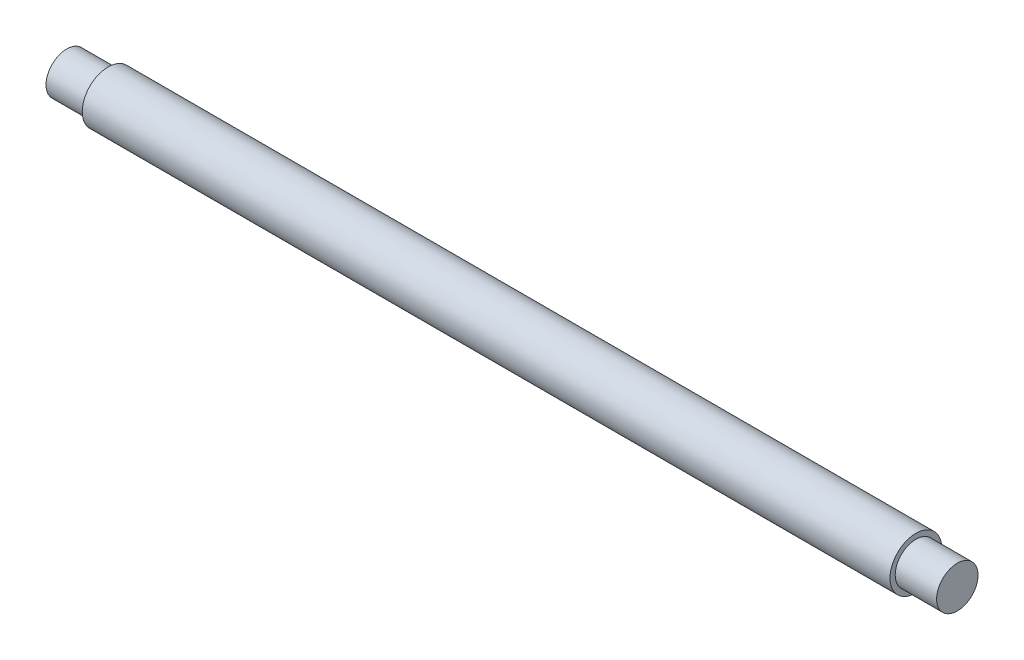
from build123d import *


with BuildPart() as part:
    # Sketch1 → Revolve1 (revolve)
    with BuildSketch(Plane.XY, mode=Mode.PRIVATE) as revolve1_sk:
        Polygon((0, 0), (0, 4), (8, 4), (8, 5), (164, 5), (164, 4), (172, 4), (172, 0), align=None)
    revolve(revolve1_sk.sketch.rotate(Axis((0, 0, 0), (1, 0, 0)), 90), axis=Axis((0, 0, 0), (1, 0, 0)))


solid = part.part
